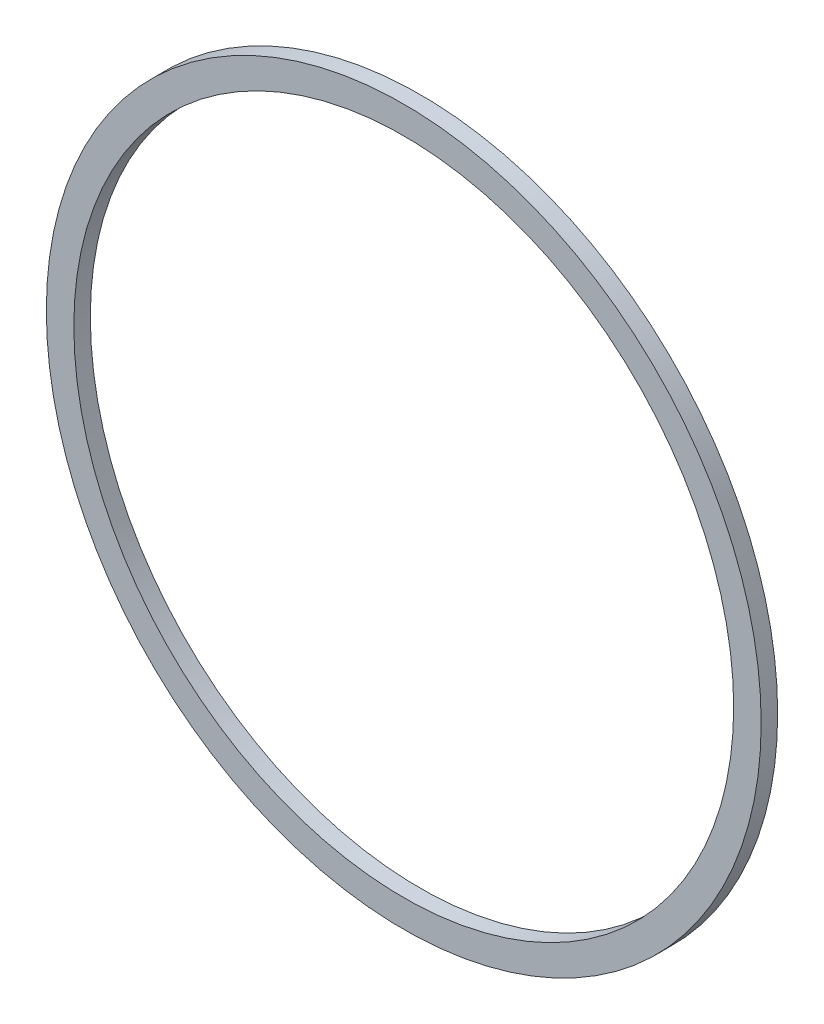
from build123d import *

# Parameters (mm, degrees)
ESQUISSE1_R      = 32.5
ESQUISSE1_R_2    = 30
EXTRUSION1_DEPTH = 1.5


with BuildPart() as part:
    # Esquisse1 → Extrusion1 (new body)
    with BuildSketch(Plane.XY):
        Circle(ESQUISSE1_R)
        Circle(ESQUISSE1_R_2, mode=Mode.SUBTRACT)
    extrude(amount=EXTRUSION1_DEPTH)


solid = part.part
